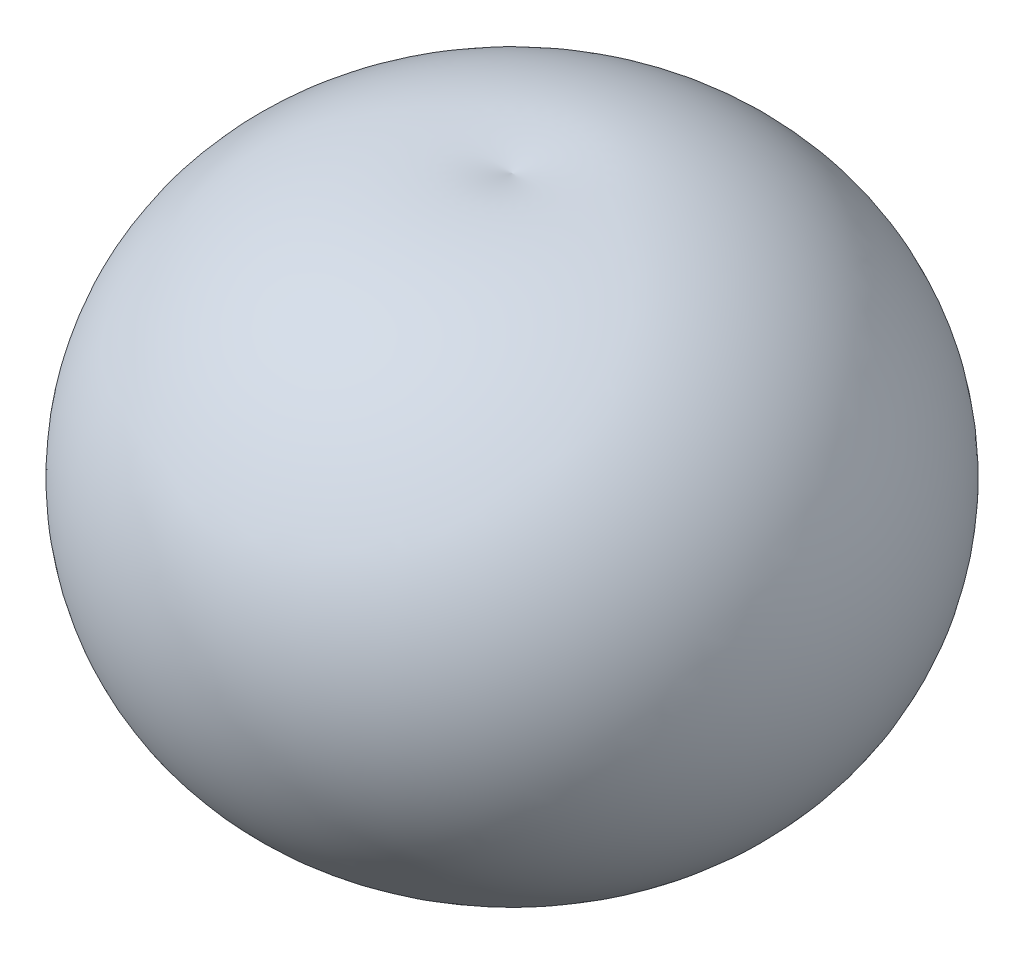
ISO-10303-21;
HEADER;
FILE_DESCRIPTION(('STEP AP214'),'2;1');
FILE_NAME('part.step','',(''),(''),'','','');
FILE_SCHEMA(('AUTOMOTIVE_DESIGN { 1 0 10303 214 1 1 1 1 }'));
ENDSEC;
DATA;
#1=APPLICATION_CONTEXT('core data for automotive mechanical design processes');
#2=APPLICATION_PROTOCOL_DEFINITION('international standard','automotive_design',2000,#1);
#3=PRODUCT_CONTEXT('',#1,'mechanical');
#4=PRODUCT('Part','Part','',(#3));
#5=PRODUCT_RELATED_PRODUCT_CATEGORY('part','',(#4));
#6=PRODUCT_DEFINITION_FORMATION('','',#4);
#7=PRODUCT_DEFINITION_CONTEXT('part definition',#1,'design');
#8=PRODUCT_DEFINITION('design','',#6,#7);
#9=PRODUCT_DEFINITION_SHAPE('','',#8);
#10=(LENGTH_UNIT() NAMED_UNIT(*) SI_UNIT(.MILLI.,.METRE.));
#11=(NAMED_UNIT(*) PLANE_ANGLE_UNIT() SI_UNIT($,.RADIAN.));
#12=(NAMED_UNIT(*) SI_UNIT($,.STERADIAN.) SOLID_ANGLE_UNIT());
#13=UNCERTAINTY_MEASURE_WITH_UNIT(LENGTH_MEASURE(1.E-05),#10,'distance_accuracy_value','');
#14=(GEOMETRIC_REPRESENTATION_CONTEXT(3) GLOBAL_UNCERTAINTY_ASSIGNED_CONTEXT((#13)) GLOBAL_UNIT_ASSIGNED_CONTEXT((#10,
#11,#12)) REPRESENTATION_CONTEXT('',''));
#15=CARTESIAN_POINT('',(0.,0.,0.));
#16=DIRECTION('',(0.,0.,1.));
#17=DIRECTION('',(1.,0.,0.));
#18=AXIS2_PLACEMENT_3D('',#15,#16,#17);
#19=CARTESIAN_POINT('',(300.,600.,0.));
#20=DIRECTION('',(0.,0.,-1.));
#21=DIRECTION('',(-1.,0.,0.));
#22=AXIS2_PLACEMENT_3D('',#19,#20,#21);
#23=CIRCLE('',#22,609.45206047);
#24=TRIMMED_CURVE('',#23,(PARAMETER_VALUE(-1.05612883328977)),
(PARAMETER_VALUE(1.05612883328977)),.T.,.PARAMETER.);
#25=CARTESIAN_POINT('',(0.,600.,0.));
#26=DIRECTION('',(0.,1.,0.));
#27=AXIS1_PLACEMENT('',#25,#26);
#28=SURFACE_OF_REVOLUTION('',#24,#27);
#29=CARTESIAN_POINT('',(0.,714.96714412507,0.));
#30=DIRECTION('',(0.,1.,0.));
#31=DIRECTION('',(-1.,0.,0.));
#32=AXIS2_PLACEMENT_3D('',#29,#30,#31);
#33=CIRCLE('',#32,298.51012504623);
#34=CARTESIAN_POINT('',(-298.51012504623,714.96714412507,0.));
#35=VERTEX_POINT('',#34);
#36=EDGE_CURVE('E68',#35,#35,#33,.T.);
#37=ORIENTED_EDGE('',*,*,#36,.F.);
#38=EDGE_LOOP('',(#37));
#39=FACE_BOUND('',#38,.T.);
#40=CARTESIAN_POINT('',(-1.11022302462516E-13,1130.5014740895,0.));
#41=VERTEX_POINT('',#40);
#42=VERTEX_LOOP('',#41);
#43=FACE_BOUND('',#42,.T.);
#44=ADVANCED_FACE('F15',(#39,#43),#28,.F.);
#45=CARTESIAN_POINT('',(0.,295.64352239,0.));
#46=DIRECTION('',(0.,1.,0.));
#47=DIRECTION('',(-1.,0.,0.));
#48=AXIS2_PLACEMENT_3D('',#45,#46,#47);
#49=DEGENERATE_TOROIDAL_SURFACE('',#48,171.52288239,629.89152068,.F.);
#50=CARTESIAN_POINT('',(0.,317.100148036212,0.));
#51=DIRECTION('',(0.,1.,0.));
#52=DIRECTION('',(-1.,0.,0.));
#53=AXIS2_PLACEMENT_3D('',#50,#51,#52);
#54=CIRCLE('',#53,458.003082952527);
#55=CARTESIAN_POINT('',(-458.003082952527,317.100148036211,0.));
#56=VERTEX_POINT('',#55);
#57=EDGE_CURVE('E71',#56,#56,#54,.T.);
#58=ORIENTED_EDGE('',*,*,#57,.F.);
#59=EDGE_LOOP('',(#58));
#60=FACE_BOUND('',#59,.T.);
#61=ORIENTED_EDGE('',*,*,#36,.T.);
#62=EDGE_LOOP('',(#61));
#63=FACE_BOUND('',#62,.T.);
#64=ADVANCED_FACE('F31',(#60,#63),#49,.T.);
#65=CARTESIAN_POINT('',(-1.11022302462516E-13,949.9999999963,0.));
#66=DIRECTION('',(0.,1.,0.));
#67=DIRECTION('',(-1.,0.,0.));
#68=AXIS2_PLACEMENT_3D('',#65,#66,#67);
#69=DEGENERATE_TOROIDAL_SURFACE('',#68,306.21778265,650.846372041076,.T.);
#70=CARTESIAN_POINT('',(0.,326.982368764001,0.));
#71=DIRECTION('',(0.,1.,0.));
#72=DIRECTION('',(-1.,0.,0.));
#73=AXIS2_PLACEMENT_3D('',#70,#71,#72);
#74=CIRCLE('',#73,494.499569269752);
#75=CARTESIAN_POINT('',(-494.499569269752,326.982368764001,0.));
#76=VERTEX_POINT('',#75);
#77=EDGE_CURVE('E19',#76,#76,#74,.T.);
#78=ORIENTED_EDGE('',*,*,#77,.F.);
#79=EDGE_LOOP('',(#78));
#80=FACE_BOUND('',#79,.T.);
#81=ORIENTED_EDGE('',*,*,#57,.T.);
#82=EDGE_LOOP('',(#81));
#83=FACE_BOUND('',#82,.T.);
#84=ADVANCED_FACE('F39',(#80,#83),#69,.T.);
#85=CARTESIAN_POINT('',(0.,168.61926407,0.));
#86=DIRECTION('',(0.,1.,0.));
#87=DIRECTION('',(0.,0.,1.));
#88=AXIS2_PLACEMENT_3D('',#85,#86,#87);
#89=DEGENERATE_TOROIDAL_SURFACE('',#88,187.35168069,700.,.F.);
#90=CARTESIAN_POINT('',(0.,-465.796186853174,0.));
#91=DIRECTION('',(0.,1.,0.));
#92=DIRECTION('',(0.,0.,1.));
#93=AXIS2_PLACEMENT_3D('',#90,#91,#92);
#94=CIRCLE('',#93,108.48110253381);
#95=CARTESIAN_POINT('',(0.,-465.796186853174,108.48110253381));
#96=VERTEX_POINT('',#95);
#97=EDGE_CURVE('E24',#96,#96,#94,.T.);
#98=ORIENTED_EDGE('',*,*,#97,.F.);
#99=EDGE_LOOP('',(#98));
#100=FACE_BOUND('',#99,.T.);
#101=ORIENTED_EDGE('',*,*,#77,.T.);
#102=EDGE_LOOP('',(#101));
#103=FACE_BOUND('',#102,.T.);
#104=ADVANCED_FACE('F17',(#100,#103),#89,.T.);
#105=CARTESIAN_POINT('',(0.,600.,300.));
#106=DIRECTION('',(-1.,0.,0.));
#107=DIRECTION('',(0.,0.,1.));
#108=AXIS2_PLACEMENT_3D('',#105,#106,#107);
#109=CIRCLE('',#108,1350.84637204);
#110=TRIMMED_CURVE('',#109,(PARAMETER_VALUE(-1.79474661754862)),
(PARAMETER_VALUE(1.79474661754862)),.T.,.PARAMETER.);
#111=CARTESIAN_POINT('',(0.,600.,0.));
#112=DIRECTION('',(0.,1.,0.));
#113=AXIS1_PLACEMENT('',#111,#112);
#114=SURFACE_OF_REVOLUTION('',#110,#113);
#115=CARTESIAN_POINT('',(0.,-624.282586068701,0.));
#116=DIRECTION('',(0.,1.,0.));
#117=DIRECTION('',(0.,0.,1.));
#118=AXIS2_PLACEMENT_3D('',#115,#116,#117);
#119=CIRCLE('',#118,870.892345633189);
#120=CARTESIAN_POINT('',(0.,-624.282586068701,870.892345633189));
#121=VERTEX_POINT('',#120);
#122=EDGE_CURVE('E10',#121,#121,#119,.T.);
#123=ORIENTED_EDGE('',*,*,#122,.T.);
#124=EDGE_LOOP('',(#123));
#125=FACE_BOUND('',#124,.T.);
#126=CARTESIAN_POINT('',(0.,1917.11272139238,0.));
#127=VERTEX_POINT('',#126);
#128=VERTEX_LOOP('',#127);
#129=FACE_BOUND('',#128,.T.);
#130=ADVANCED_FACE('F47',(#125,#129),#114,.T.);
#131=CARTESIAN_POINT('',(0.,-34.4154509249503,0.));
#132=DIRECTION('',(0.,1.,0.));
#133=DIRECTION('',(0.,0.,1.));
#134=AXIS2_PLACEMENT_3D('',#131,#132,#133);
#135=DEGENERATE_TOROIDAL_SURFACE('',#134,595.83278322,650.84637204,.T.);
#136=ORIENTED_EDGE('',*,*,#97,.T.);
#137=EDGE_LOOP('',(#136));
#138=FACE_BOUND('',#137,.T.);
#139=ORIENTED_EDGE('',*,*,#122,.F.);
#140=EDGE_LOOP('',(#139));
#141=FACE_BOUND('',#140,.T.);
#142=ADVANCED_FACE('F45',(#138,#141),#135,.T.);
#143=CLOSED_SHELL('',(#44,#64,#84,#104,#130,#142));
#144=MANIFOLD_SOLID_BREP('B1',#143);
#145=ADVANCED_BREP_SHAPE_REPRESENTATION('',(#18,#144),#14);
#146=SHAPE_DEFINITION_REPRESENTATION(#9,#145);
ENDSEC;
END-ISO-10303-21;
